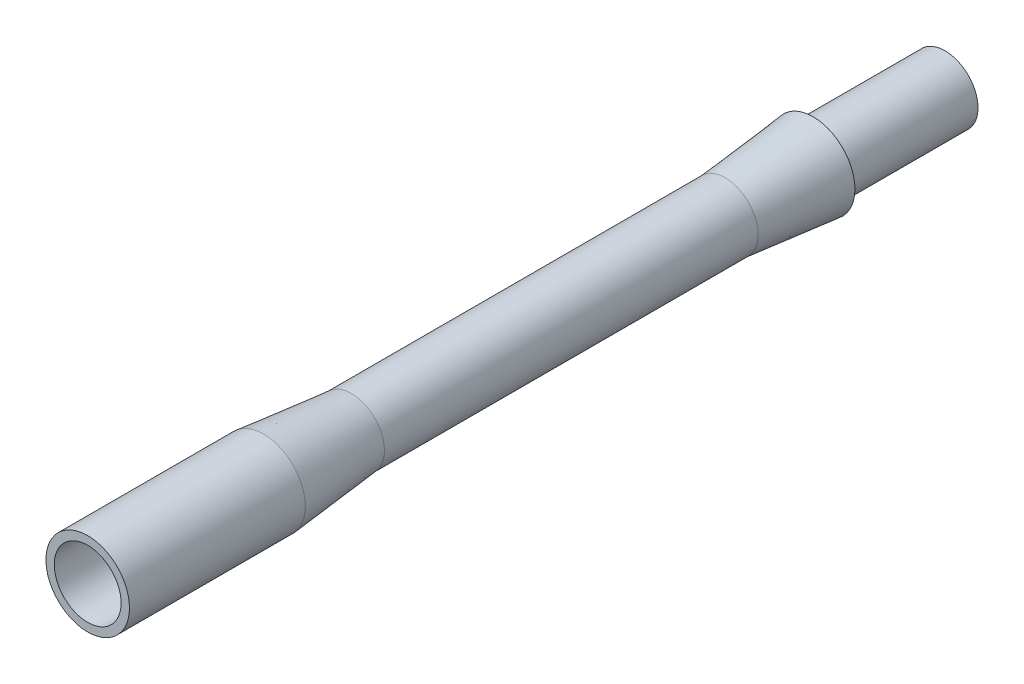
ISO-10303-21;
HEADER;
FILE_DESCRIPTION(('STEP AP214'),'2;1');
FILE_NAME('part.step','',(''),(''),'','','');
FILE_SCHEMA(('AUTOMOTIVE_DESIGN { 1 0 10303 214 1 1 1 1 }'));
ENDSEC;
DATA;
#1=APPLICATION_CONTEXT('core data for automotive mechanical design processes');
#2=APPLICATION_PROTOCOL_DEFINITION('international standard','automotive_design',2000,#1);
#3=PRODUCT_CONTEXT('',#1,'mechanical');
#4=PRODUCT('Part','Part','',(#3));
#5=PRODUCT_RELATED_PRODUCT_CATEGORY('part','',(#4));
#6=PRODUCT_DEFINITION_FORMATION('','',#4);
#7=PRODUCT_DEFINITION_CONTEXT('part definition',#1,'design');
#8=PRODUCT_DEFINITION('design','',#6,#7);
#9=PRODUCT_DEFINITION_SHAPE('','',#8);
#10=(LENGTH_UNIT() NAMED_UNIT(*) SI_UNIT(.MILLI.,.METRE.));
#11=(NAMED_UNIT(*) PLANE_ANGLE_UNIT() SI_UNIT($,.RADIAN.));
#12=(NAMED_UNIT(*) SI_UNIT($,.STERADIAN.) SOLID_ANGLE_UNIT());
#13=UNCERTAINTY_MEASURE_WITH_UNIT(LENGTH_MEASURE(1.E-05),#10,'distance_accuracy_value','');
#14=(GEOMETRIC_REPRESENTATION_CONTEXT(3) GLOBAL_UNCERTAINTY_ASSIGNED_CONTEXT((#13)) GLOBAL_UNIT_ASSIGNED_CONTEXT((#10,
#11,#12)) REPRESENTATION_CONTEXT('',''));
#15=CARTESIAN_POINT('',(0.,0.,0.));
#16=DIRECTION('',(0.,0.,1.));
#17=DIRECTION('',(1.,0.,0.));
#18=AXIS2_PLACEMENT_3D('',#15,#16,#17);
#19=CARTESIAN_POINT('',(0.,0.,-40.));
#20=DIRECTION('',(0.,0.,1.));
#21=DIRECTION('',(1.,0.,0.));
#22=AXIS2_PLACEMENT_3D('',#19,#20,#21);
#23=CYLINDRICAL_SURFACE('',#22,7.6);
#24=CARTESIAN_POINT('',(0.,0.,0.));
#25=DIRECTION('',(0.,0.,1.));
#26=DIRECTION('',(1.,0.,0.));
#27=AXIS2_PLACEMENT_3D('',#24,#25,#26);
#28=CIRCLE('',#27,7.6);
#29=CARTESIAN_POINT('',(7.6,0.,0.));
#30=VERTEX_POINT('',#29);
#31=EDGE_CURVE('E46',#30,#30,#28,.T.);
#32=ORIENTED_EDGE('',*,*,#31,.T.);
#33=EDGE_LOOP('',(#32));
#34=FACE_BOUND('',#33,.T.);
#35=CARTESIAN_POINT('',(0.,0.,-38.15));
#36=DIRECTION('',(0.,0.,1.));
#37=DIRECTION('',(1.,0.,0.));
#38=AXIS2_PLACEMENT_3D('',#35,#36,#37);
#39=CIRCLE('',#38,7.6);
#40=CARTESIAN_POINT('',(7.6,0.,-38.15));
#41=VERTEX_POINT('',#40);
#42=EDGE_CURVE('E10',#41,#41,#39,.T.);
#43=ORIENTED_EDGE('',*,*,#42,.F.);
#44=EDGE_LOOP('',(#43));
#45=FACE_BOUND('',#44,.T.);
#46=ADVANCED_FACE('F31',(#34,#45),#23,.F.);
#47=CARTESIAN_POINT('',(0.,0.,-165.));
#48=DIRECTION('',(0.,0.,1.));
#49=DIRECTION('',(1.,0.,0.));
#50=AXIS2_PLACEMENT_3D('',#47,#48,#49);
#51=CYLINDRICAL_SURFACE('',#50,7.5);
#52=CARTESIAN_POINT('',(0.,0.,-60.));
#53=DIRECTION('',(0.,0.,1.));
#54=DIRECTION('',(1.,0.,0.));
#55=AXIS2_PLACEMENT_3D('',#52,#53,#54);
#56=CIRCLE('',#55,7.5);
#57=CARTESIAN_POINT('',(7.5,0.,-60.));
#58=VERTEX_POINT('',#57);
#59=EDGE_CURVE('E54',#58,#58,#56,.F.);
#60=ORIENTED_EDGE('',*,*,#59,.T.);
#61=EDGE_LOOP('',(#60));
#62=FACE_BOUND('',#61,.T.);
#63=CARTESIAN_POINT('',(0.,0.,-145.));
#64=DIRECTION('',(0.,0.,-1.));
#65=DIRECTION('',(0.,1.,0.));
#66=AXIS2_PLACEMENT_3D('',#63,#64,#65);
#67=CIRCLE('',#66,7.5);
#68=CARTESIAN_POINT('',(0.,7.50000000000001,-145.));
#69=VERTEX_POINT('',#68);
#70=EDGE_CURVE('E38',#69,#69,#67,.T.);
#71=ORIENTED_EDGE('',*,*,#70,.F.);
#72=EDGE_LOOP('',(#71));
#73=FACE_BOUND('',#72,.T.);
#74=ADVANCED_FACE('F93',(#62,#73),#51,.T.);
#75=CARTESIAN_POINT('',(0.,0.,-40.));
#76=DIRECTION('',(0.,0.,1.));
#77=DIRECTION('',(1.,0.,0.));
#78=AXIS2_PLACEMENT_3D('',#75,#76,#77);
#79=CYLINDRICAL_SURFACE('',#78,9.5);
#80=CARTESIAN_POINT('',(0.,0.,-40.));
#81=DIRECTION('',(0.,0.,1.));
#82=DIRECTION('',(1.,0.,0.));
#83=AXIS2_PLACEMENT_3D('',#80,#81,#82);
#84=CIRCLE('',#83,9.5);
#85=CARTESIAN_POINT('',(9.5,0.,-40.));
#86=VERTEX_POINT('',#85);
#87=EDGE_CURVE('E51',#86,#86,#84,.T.);
#88=ORIENTED_EDGE('',*,*,#87,.T.);
#89=EDGE_LOOP('',(#88));
#90=FACE_BOUND('',#89,.T.);
#91=CARTESIAN_POINT('',(0.,0.,0.));
#92=DIRECTION('',(0.,0.,1.));
#93=DIRECTION('',(1.,0.,0.));
#94=AXIS2_PLACEMENT_3D('',#91,#92,#93);
#95=CIRCLE('',#94,9.5);
#96=CARTESIAN_POINT('',(9.5,0.,0.));
#97=VERTEX_POINT('',#96);
#98=EDGE_CURVE('E42',#97,#97,#95,.T.);
#99=ORIENTED_EDGE('',*,*,#98,.F.);
#100=EDGE_LOOP('',(#99));
#101=FACE_BOUND('',#100,.T.);
#102=ADVANCED_FACE('F33',(#90,#101),#79,.T.);
#103=CARTESIAN_POINT('',(0.,0.,0.));
#104=DIRECTION('',(0.,0.,1.));
#105=DIRECTION('',(1.,0.,0.));
#106=AXIS2_PLACEMENT_3D('',#103,#104,#105);
#107=PLANE('',#106);
#108=ORIENTED_EDGE('',*,*,#31,.F.);
#109=EDGE_LOOP('',(#108));
#110=FACE_BOUND('',#109,.T.);
#111=ORIENTED_EDGE('',*,*,#98,.T.);
#112=EDGE_LOOP('',(#111));
#113=FACE_BOUND('',#112,.T.);
#114=ADVANCED_FACE('F106',(#110,#113),#107,.T.);
#115=CARTESIAN_POINT('',(0.,0.,-60.));
#116=DIRECTION('',(0.,0.,1.));
#117=DIRECTION('',(1.,0.,0.));
#118=AXIS2_PLACEMENT_3D('',#115,#116,#117);
#119=CONICAL_SURFACE('',#118,7.5,0.099668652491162);
#120=ORIENTED_EDGE('',*,*,#87,.F.);
#121=EDGE_LOOP('',(#120));
#122=FACE_BOUND('',#121,.T.);
#123=ORIENTED_EDGE('',*,*,#59,.F.);
#124=EDGE_LOOP('',(#123));
#125=FACE_BOUND('',#124,.T.);
#126=ADVANCED_FACE('F105',(#122,#125),#119,.T.);
#127=CARTESIAN_POINT('',(0.,0.,-165.));
#128=DIRECTION('',(0.,0.,-1.));
#129=DIRECTION('',(0.,1.,0.));
#130=AXIS2_PLACEMENT_3D('',#127,#128,#129);
#131=CIRCLE('',#130,7.5);
#132=CARTESIAN_POINT('',(0.,7.5,-165.));
#133=VERTEX_POINT('',#132);
#134=EDGE_CURVE('E69',#133,#133,#131,.T.);
#135=ORIENTED_EDGE('',*,*,#134,.T.);
#136=EDGE_LOOP('',(#135));
#137=FACE_BOUND('',#136,.T.);
#138=CARTESIAN_POINT('',(0.,0.,-195.));
#139=DIRECTION('',(0.,0.,-1.));
#140=DIRECTION('',(-1.,0.,0.));
#141=AXIS2_PLACEMENT_3D('',#138,#139,#140);
#142=CIRCLE('',#141,7.5);
#143=CARTESIAN_POINT('',(-7.5,0.,-195.));
#144=VERTEX_POINT('',#143);
#145=EDGE_CURVE('E60',#144,#144,#142,.T.);
#146=ORIENTED_EDGE('',*,*,#145,.F.);
#147=EDGE_LOOP('',(#146));
#148=FACE_BOUND('',#147,.T.);
#149=ADVANCED_FACE('F73',(#137,#148),#51,.T.);
#150=CARTESIAN_POINT('',(0.,0.,-21.6152236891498));
#151=DIRECTION('',(0.,0.,-1.));
#152=DIRECTION('',(-1.,0.,0.));
#153=AXIS2_PLACEMENT_3D('',#150,#151,#152);
#154=CYLINDRICAL_SURFACE('',#153,5.75);
#155=CARTESIAN_POINT('',(0.,0.,-40.));
#156=DIRECTION('',(0.,0.,1.));
#157=DIRECTION('',(1.,0.,0.));
#158=AXIS2_PLACEMENT_3D('',#155,#156,#157);
#159=CIRCLE('',#158,5.75);
#160=CARTESIAN_POINT('',(5.75,0.,-40.));
#161=VERTEX_POINT('',#160);
#162=EDGE_CURVE('E57',#161,#161,#159,.F.);
#163=ORIENTED_EDGE('',*,*,#162,.F.);
#164=EDGE_LOOP('',(#163));
#165=FACE_BOUND('',#164,.T.);
#166=CARTESIAN_POINT('',(0.,0.,-195.));
#167=DIRECTION('',(0.,0.,-1.));
#168=DIRECTION('',(-1.,0.,0.));
#169=AXIS2_PLACEMENT_3D('',#166,#167,#168);
#170=CIRCLE('',#169,5.75);
#171=CARTESIAN_POINT('',(-5.75,0.,-195.));
#172=VERTEX_POINT('',#171);
#173=EDGE_CURVE('E63',#172,#172,#170,.T.);
#174=ORIENTED_EDGE('',*,*,#173,.T.);
#175=EDGE_LOOP('',(#174));
#176=FACE_BOUND('',#175,.T.);
#177=ADVANCED_FACE('F89',(#165,#176),#154,.F.);
#178=CARTESIAN_POINT('',(0.,0.,-195.));
#179=DIRECTION('',(0.,0.,-1.));
#180=DIRECTION('',(-1.,0.,0.));
#181=AXIS2_PLACEMENT_3D('',#178,#179,#180);
#182=PLANE('',#181);
#183=ORIENTED_EDGE('',*,*,#145,.T.);
#184=EDGE_LOOP('',(#183));
#185=FACE_BOUND('',#184,.T.);
#186=ORIENTED_EDGE('',*,*,#173,.F.);
#187=EDGE_LOOP('',(#186));
#188=FACE_BOUND('',#187,.T.);
#189=ADVANCED_FACE('F79',(#185,#188),#182,.T.);
#190=CARTESIAN_POINT('',(0.,7.5,-165.));
#191=DIRECTION('',(0.,0.,-1.));
#192=DIRECTION('',(0.,1.,0.));
#193=AXIS2_PLACEMENT_3D('',#190,#191,#192);
#194=PLANE('',#193);
#195=CARTESIAN_POINT('',(0.,0.,-165.));
#196=DIRECTION('',(0.,0.,-1.));
#197=DIRECTION('',(0.,1.,0.));
#198=AXIS2_PLACEMENT_3D('',#195,#196,#197);
#199=CIRCLE('',#198,9.5);
#200=CARTESIAN_POINT('',(0.,9.5,-165.));
#201=VERTEX_POINT('',#200);
#202=EDGE_CURVE('E66',#201,#201,#199,.T.);
#203=ORIENTED_EDGE('',*,*,#202,.T.);
#204=EDGE_LOOP('',(#203));
#205=FACE_BOUND('',#204,.T.);
#206=ORIENTED_EDGE('',*,*,#134,.F.);
#207=EDGE_LOOP('',(#206));
#208=FACE_BOUND('',#207,.T.);
#209=ADVANCED_FACE('F76',(#205,#208),#194,.T.);
#210=CARTESIAN_POINT('',(0.,0.,-145.));
#211=DIRECTION('',(0.,0.,-1.));
#212=DIRECTION('',(0.,1.,0.));
#213=AXIS2_PLACEMENT_3D('',#210,#211,#212);
#214=CONICAL_SURFACE('',#213,7.49999999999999,0.0996686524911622);
#215=ORIENTED_EDGE('',*,*,#202,.F.);
#216=EDGE_LOOP('',(#215));
#217=FACE_BOUND('',#216,.T.);
#218=ORIENTED_EDGE('',*,*,#70,.T.);
#219=EDGE_LOOP('',(#218));
#220=FACE_BOUND('',#219,.T.);
#221=ADVANCED_FACE('F78',(#217,#220),#214,.T.);
#222=CARTESIAN_POINT('',(0.,0.,-40.));
#223=DIRECTION('',(0.,0.,1.));
#224=DIRECTION('',(1.,0.,0.));
#225=AXIS2_PLACEMENT_3D('',#222,#223,#224);
#226=CONICAL_SURFACE('',#225,5.75,0.785398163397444);
#227=ORIENTED_EDGE('',*,*,#42,.T.);
#228=EDGE_LOOP('',(#227));
#229=FACE_BOUND('',#228,.T.);
#230=ORIENTED_EDGE('',*,*,#162,.T.);
#231=EDGE_LOOP('',(#230));
#232=FACE_BOUND('',#231,.T.);
#233=ADVANCED_FACE('F86',(#229,#232),#226,.F.);
#234=CLOSED_SHELL('',(#46,#74,#102,#114,#126,#149,#177,#189,#209,#221,#233));
#235=MANIFOLD_SOLID_BREP('B2',#234);
#236=ADVANCED_BREP_SHAPE_REPRESENTATION('',(#18,#235),#14);
#237=SHAPE_DEFINITION_REPRESENTATION(#9,#236);
ENDSEC;
END-ISO-10303-21;
